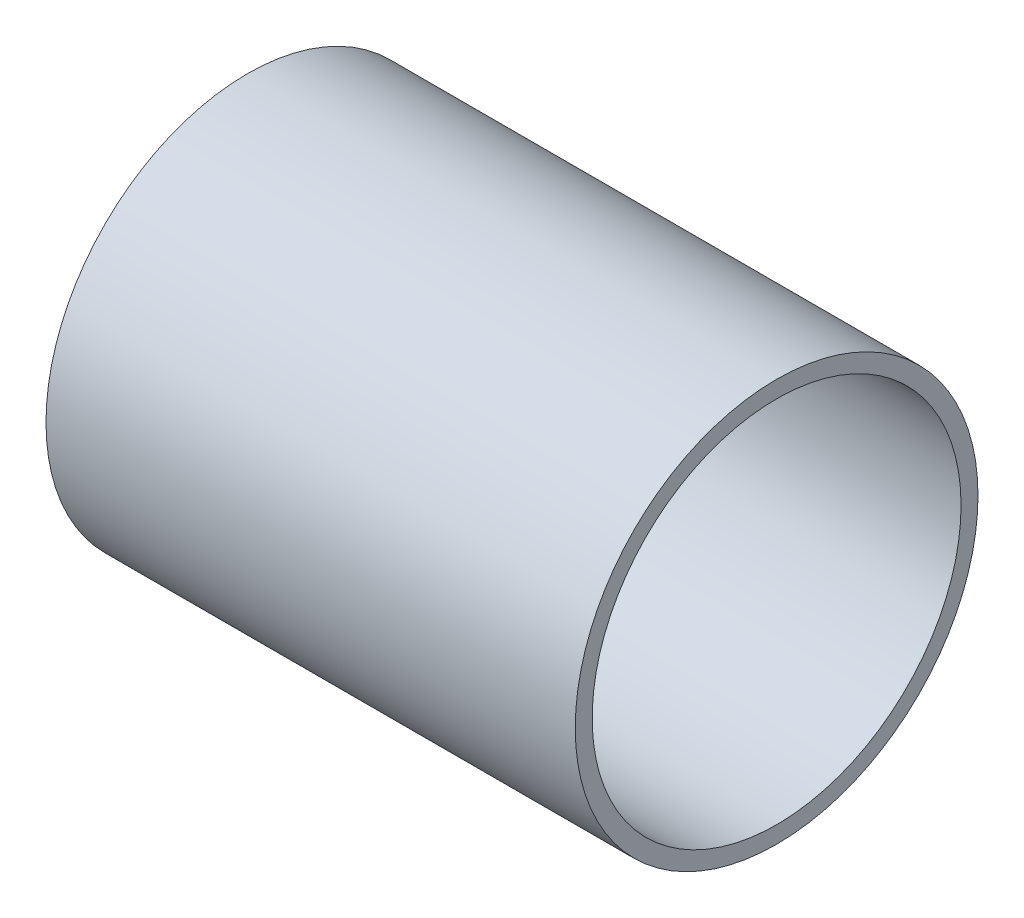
from build123d import *

# Parameters (mm, degrees)
ESQUISSE2_R   = 38.05
ESQUISSE2_R_2 = 34.85


with BuildPart() as part:
    # Balayage1: sweep along a path in Esquisse1
    with BuildLine(Plane.XY) as balayage1_path:
        Line((0, 0), (100, 0))
    # Esquisse2 → Balayage1 (sweep)
    with BuildSketch(Plane(origin=(0, 0, 0), x_dir=(0, 0, -1), z_dir=(1, 0, 0))):
        Circle(ESQUISSE2_R)
        Circle(ESQUISSE2_R_2, mode=Mode.SUBTRACT)
    sweep(path=balayage1_path.line)


solid = part.part
